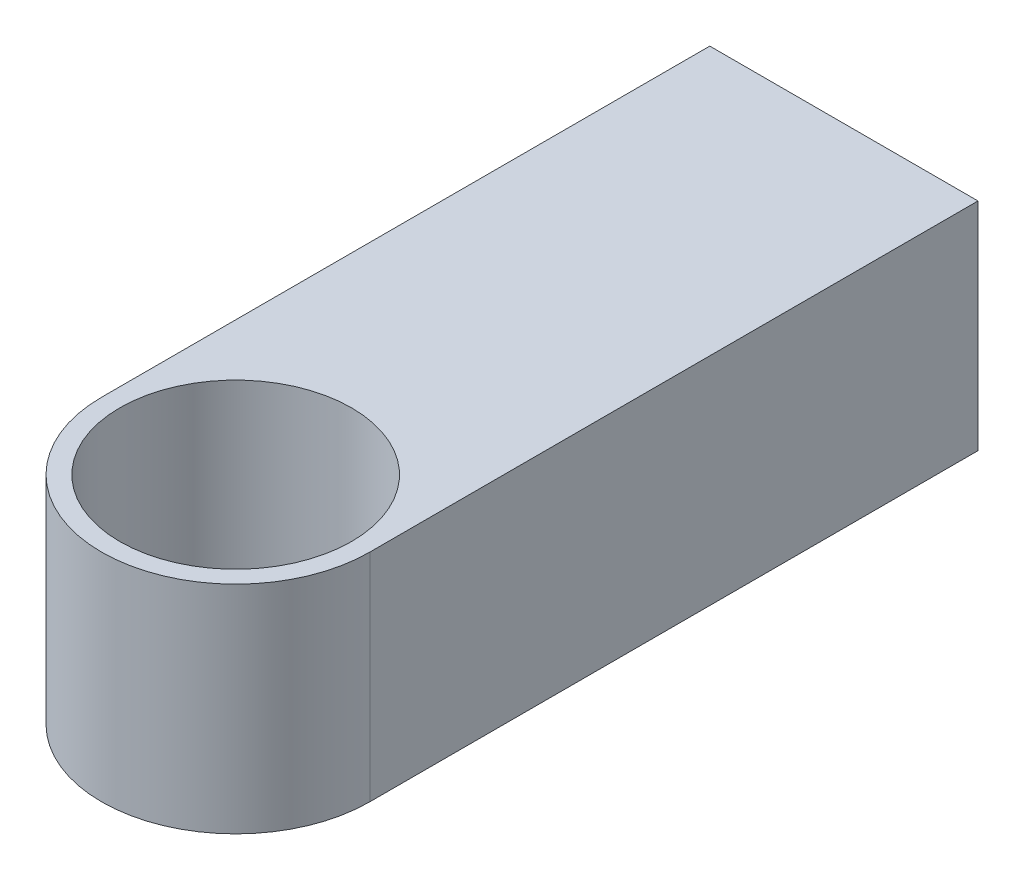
ISO-10303-21;
HEADER;
FILE_DESCRIPTION(('STEP AP214'),'2;1');
FILE_NAME('part.step','',(''),(''),'','','');
FILE_SCHEMA(('AUTOMOTIVE_DESIGN { 1 0 10303 214 1 1 1 1 }'));
ENDSEC;
DATA;
#1=APPLICATION_CONTEXT('core data for automotive mechanical design processes');
#2=APPLICATION_PROTOCOL_DEFINITION('international standard','automotive_design',2000,#1);
#3=PRODUCT_CONTEXT('',#1,'mechanical');
#4=PRODUCT('Part','Part','',(#3));
#5=PRODUCT_RELATED_PRODUCT_CATEGORY('part','',(#4));
#6=PRODUCT_DEFINITION_FORMATION('','',#4);
#7=PRODUCT_DEFINITION_CONTEXT('part definition',#1,'design');
#8=PRODUCT_DEFINITION('design','',#6,#7);
#9=PRODUCT_DEFINITION_SHAPE('','',#8);
#10=(LENGTH_UNIT() NAMED_UNIT(*) SI_UNIT(.MILLI.,.METRE.));
#11=(NAMED_UNIT(*) PLANE_ANGLE_UNIT() SI_UNIT($,.RADIAN.));
#12=(NAMED_UNIT(*) SI_UNIT($,.STERADIAN.) SOLID_ANGLE_UNIT());
#13=UNCERTAINTY_MEASURE_WITH_UNIT(LENGTH_MEASURE(1.E-05),#10,'distance_accuracy_value','');
#14=(GEOMETRIC_REPRESENTATION_CONTEXT(3) GLOBAL_UNCERTAINTY_ASSIGNED_CONTEXT((#13)) GLOBAL_UNIT_ASSIGNED_CONTEXT((#10,
#11,#12)) REPRESENTATION_CONTEXT('',''));
#15=CARTESIAN_POINT('',(0.,0.,0.));
#16=DIRECTION('',(0.,0.,1.));
#17=DIRECTION('',(1.,0.,0.));
#18=AXIS2_PLACEMENT_3D('',#15,#16,#17);
#19=CARTESIAN_POINT('',(0.,35.56,0.));
#20=DIRECTION('',(0.,1.,0.));
#21=DIRECTION('',(-1.,0.,0.));
#22=AXIS2_PLACEMENT_3D('',#19,#20,#21);
#23=CYLINDRICAL_SURFACE('',#22,22.05);
#24=DIRECTION('',(0.,1.,0.));
#25=VECTOR('',#24,1.);
#26=CARTESIAN_POINT('',(-22.05,-109.292314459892,0.));
#27=LINE('',#26,#25);
#28=CARTESIAN_POINT('',(-22.05,0.,0.));
#29=VERTEX_POINT('',#28);
#30=CARTESIAN_POINT('',(-22.05,35.56,0.));
#31=VERTEX_POINT('',#30);
#32=EDGE_CURVE('E97',#29,#31,#27,.T.);
#33=ORIENTED_EDGE('',*,*,#32,.F.);
#34=CARTESIAN_POINT('',(0.,0.,0.));
#35=DIRECTION('',(0.,1.,0.));
#36=DIRECTION('',(-1.,0.,0.));
#37=AXIS2_PLACEMENT_3D('',#34,#35,#36);
#38=CIRCLE('',#37,22.05);
#39=CARTESIAN_POINT('',(22.05,0.,0.));
#40=VERTEX_POINT('',#39);
#41=EDGE_CURVE('E11',#29,#40,#38,.T.);
#42=ORIENTED_EDGE('',*,*,#41,.T.);
#43=DIRECTION('',(0.,1.,0.));
#44=VECTOR('',#43,1.);
#45=CARTESIAN_POINT('',(22.05,-109.292314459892,0.));
#46=LINE('',#45,#44);
#47=CARTESIAN_POINT('',(22.05,35.56,0.));
#48=VERTEX_POINT('',#47);
#49=EDGE_CURVE('E86',#40,#48,#46,.T.);
#50=ORIENTED_EDGE('',*,*,#49,.T.);
#51=CARTESIAN_POINT('',(0.,35.56,0.));
#52=DIRECTION('',(0.,1.,0.));
#53=DIRECTION('',(-1.,0.,0.));
#54=AXIS2_PLACEMENT_3D('',#51,#52,#53);
#55=CIRCLE('',#54,22.05);
#56=EDGE_CURVE('E96',#31,#48,#55,.T.);
#57=ORIENTED_EDGE('',*,*,#56,.F.);
#58=EDGE_LOOP('',(#33,#42,#50,#57));
#59=FACE_BOUND('',#58,.T.);
#60=ADVANCED_FACE('F41',(#59),#23,.T.);
#61=CARTESIAN_POINT('',(0.,0.,0.));
#62=DIRECTION('',(0.,1.,0.));
#63=DIRECTION('',(-1.,0.,0.));
#64=AXIS2_PLACEMENT_3D('',#61,#62,#63);
#65=PLANE('',#64);
#66=ORIENTED_EDGE('',*,*,#41,.F.);
#67=DIRECTION('',(0.,0.,1.));
#68=VECTOR('',#67,1.);
#69=CARTESIAN_POINT('',(-22.05,0.,0.));
#70=LINE('',#69,#68);
#71=CARTESIAN_POINT('',(-22.05,0.,-100.));
#72=VERTEX_POINT('',#71);
#73=EDGE_CURVE('E108',#72,#29,#70,.T.);
#74=ORIENTED_EDGE('',*,*,#73,.F.);
#75=DIRECTION('',(-1.,0.,0.));
#76=VECTOR('',#75,1.);
#77=CARTESIAN_POINT('',(-22.05,0.,-100.));
#78=LINE('',#77,#76);
#79=CARTESIAN_POINT('',(22.05,0.,-100.));
#80=VERTEX_POINT('',#79);
#81=EDGE_CURVE('E101',#80,#72,#78,.T.);
#82=ORIENTED_EDGE('',*,*,#81,.F.);
#83=DIRECTION('',(0.,0.,-1.));
#84=VECTOR('',#83,1.);
#85=CARTESIAN_POINT('',(22.05,0.,-100.));
#86=LINE('',#85,#84);
#87=EDGE_CURVE('E63',#40,#80,#86,.T.);
#88=ORIENTED_EDGE('',*,*,#87,.F.);
#89=EDGE_LOOP('',(#66,#74,#82,#88));
#90=FACE_BOUND('',#89,.T.);
#91=ADVANCED_FACE('F132',(#90),#65,.F.);
#92=CARTESIAN_POINT('',(3.,3.,0.));
#93=DIRECTION('',(0.,-1.,0.));
#94=DIRECTION('',(1.,0.,0.));
#95=AXIS2_PLACEMENT_3D('',#92,#93,#94);
#96=PLANE('',#95);
#97=CARTESIAN_POINT('',(0.,3.,0.));
#98=DIRECTION('',(0.,1.,0.));
#99=DIRECTION('',(-1.,0.,0.));
#100=AXIS2_PLACEMENT_3D('',#97,#98,#99);
#101=CIRCLE('',#100,19.05);
#102=CARTESIAN_POINT('',(-19.05,3.,0.));
#103=VERTEX_POINT('',#102);
#104=EDGE_CURVE('E48',#103,#103,#101,.T.);
#105=ORIENTED_EDGE('',*,*,#104,.T.);
#106=EDGE_LOOP('',(#105));
#107=FACE_BOUND('',#106,.T.);
#108=ADVANCED_FACE('F113',(#107),#96,.F.);
#109=CARTESIAN_POINT('',(0.,35.56,0.));
#110=DIRECTION('',(0.,1.,0.));
#111=DIRECTION('',(-1.,0.,0.));
#112=AXIS2_PLACEMENT_3D('',#109,#110,#111);
#113=CYLINDRICAL_SURFACE('',#112,19.05);
#114=ORIENTED_EDGE('',*,*,#104,.F.);
#115=EDGE_LOOP('',(#114));
#116=FACE_BOUND('',#115,.T.);
#117=CARTESIAN_POINT('',(0.,35.56,0.));
#118=DIRECTION('',(0.,1.,0.));
#119=DIRECTION('',(-1.,0.,0.));
#120=AXIS2_PLACEMENT_3D('',#117,#118,#119);
#121=CIRCLE('',#120,19.05);
#122=CARTESIAN_POINT('',(-19.05,35.56,0.));
#123=VERTEX_POINT('',#122);
#124=EDGE_CURVE('E100',#123,#123,#121,.T.);
#125=ORIENTED_EDGE('',*,*,#124,.T.);
#126=EDGE_LOOP('',(#125));
#127=FACE_BOUND('',#126,.T.);
#128=ADVANCED_FACE('F115',(#116,#127),#113,.F.);
#129=CARTESIAN_POINT('',(19.05,35.56,0.));
#130=DIRECTION('',(0.,-1.,0.));
#131=DIRECTION('',(1.,0.,0.));
#132=AXIS2_PLACEMENT_3D('',#129,#130,#131);
#133=PLANE('',#132);
#134=ORIENTED_EDGE('',*,*,#124,.F.);
#135=EDGE_LOOP('',(#134));
#136=FACE_BOUND('',#135,.T.);
#137=ORIENTED_EDGE('',*,*,#56,.T.);
#138=DIRECTION('',(0.,0.,-1.));
#139=VECTOR('',#138,1.);
#140=CARTESIAN_POINT('',(22.05,35.56,-100.));
#141=LINE('',#140,#139);
#142=CARTESIAN_POINT('',(22.05,35.56,-100.));
#143=VERTEX_POINT('',#142);
#144=EDGE_CURVE('E83',#48,#143,#141,.T.);
#145=ORIENTED_EDGE('',*,*,#144,.T.);
#146=DIRECTION('',(-1.,0.,0.));
#147=VECTOR('',#146,1.);
#148=CARTESIAN_POINT('',(-22.05,35.56,-100.));
#149=LINE('',#148,#147);
#150=CARTESIAN_POINT('',(-22.05,35.56,-100.));
#151=VERTEX_POINT('',#150);
#152=EDGE_CURVE('E91',#143,#151,#149,.T.);
#153=ORIENTED_EDGE('',*,*,#152,.T.);
#154=DIRECTION('',(0.,0.,1.));
#155=VECTOR('',#154,1.);
#156=CARTESIAN_POINT('',(-22.05,35.56,0.));
#157=LINE('',#156,#155);
#158=EDGE_CURVE('E55',#151,#31,#157,.T.);
#159=ORIENTED_EDGE('',*,*,#158,.T.);
#160=EDGE_LOOP('',(#137,#145,#153,#159));
#161=FACE_BOUND('',#160,.T.);
#162=ADVANCED_FACE('F99',(#136,#161),#133,.F.);
#163=CARTESIAN_POINT('',(-22.05,-109.292314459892,0.));
#164=DIRECTION('',(1.,0.,0.));
#165=DIRECTION('',(0.,0.,-1.));
#166=AXIS2_PLACEMENT_3D('',#163,#164,#165);
#167=PLANE('',#166);
#168=DIRECTION('',(0.,1.,0.));
#169=VECTOR('',#168,1.);
#170=CARTESIAN_POINT('',(-22.05,-109.292314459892,-100.));
#171=LINE('',#170,#169);
#172=EDGE_CURVE('E90',#72,#151,#171,.T.);
#173=ORIENTED_EDGE('',*,*,#172,.F.);
#174=ORIENTED_EDGE('',*,*,#73,.T.);
#175=ORIENTED_EDGE('',*,*,#32,.T.);
#176=ORIENTED_EDGE('',*,*,#158,.F.);
#177=EDGE_LOOP('',(#173,#174,#175,#176));
#178=FACE_BOUND('',#177,.T.);
#179=ADVANCED_FACE('F122',(#178),#167,.F.);
#180=CARTESIAN_POINT('',(22.05,-109.292314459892,-100.));
#181=DIRECTION('',(-1.,0.,0.));
#182=DIRECTION('',(0.,0.,1.));
#183=AXIS2_PLACEMENT_3D('',#180,#181,#182);
#184=PLANE('',#183);
#185=ORIENTED_EDGE('',*,*,#49,.F.);
#186=ORIENTED_EDGE('',*,*,#87,.T.);
#187=DIRECTION('',(0.,1.,0.));
#188=VECTOR('',#187,1.);
#189=CARTESIAN_POINT('',(22.05,-109.292314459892,-100.));
#190=LINE('',#189,#188);
#191=EDGE_CURVE('E88',#80,#143,#190,.T.);
#192=ORIENTED_EDGE('',*,*,#191,.T.);
#193=ORIENTED_EDGE('',*,*,#144,.F.);
#194=EDGE_LOOP('',(#185,#186,#192,#193));
#195=FACE_BOUND('',#194,.T.);
#196=ADVANCED_FACE('F85',(#195),#184,.F.);
#197=CARTESIAN_POINT('',(-22.05,-109.292314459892,-100.));
#198=DIRECTION('',(0.,0.,1.));
#199=DIRECTION('',(1.,0.,0.));
#200=AXIS2_PLACEMENT_3D('',#197,#198,#199);
#201=PLANE('',#200);
#202=ORIENTED_EDGE('',*,*,#191,.F.);
#203=ORIENTED_EDGE('',*,*,#81,.T.);
#204=ORIENTED_EDGE('',*,*,#172,.T.);
#205=ORIENTED_EDGE('',*,*,#152,.F.);
#206=EDGE_LOOP('',(#202,#203,#204,#205));
#207=FACE_BOUND('',#206,.T.);
#208=ADVANCED_FACE('F141',(#207),#201,.F.);
#209=CLOSED_SHELL('',(#60,#91,#108,#128,#162,#179,#196,#208));
#210=MANIFOLD_SOLID_BREP('B2',#209);
#211=ADVANCED_BREP_SHAPE_REPRESENTATION('',(#18,#210),#14);
#212=SHAPE_DEFINITION_REPRESENTATION(#9,#211);
ENDSEC;
END-ISO-10303-21;
